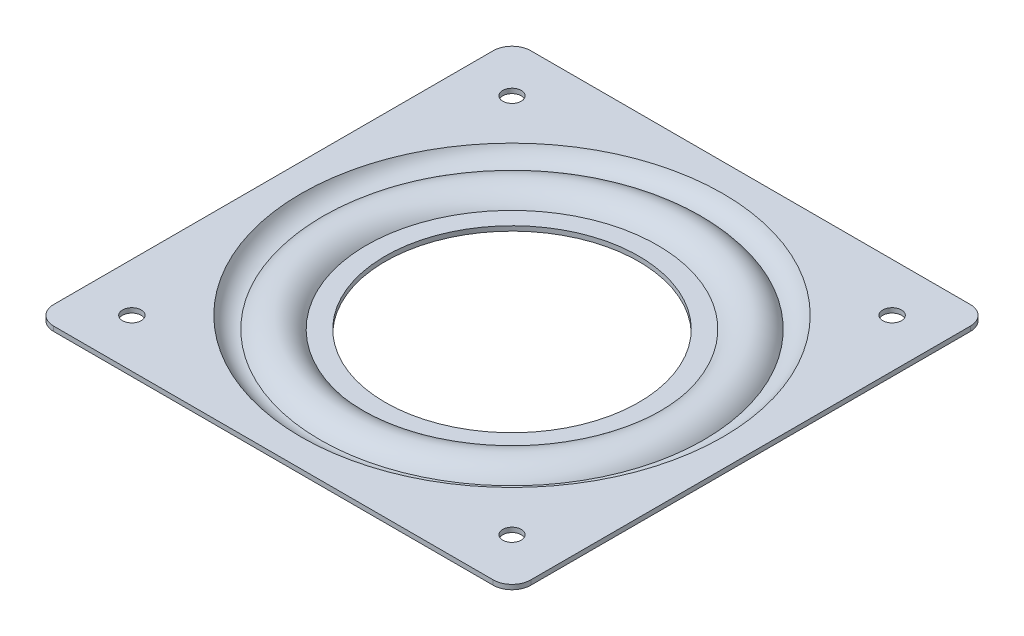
from build123d import *

# Parameters (mm, degrees)
SKETCH_2_R      = 1.985
SKETCH_2_R_2    = 44.910539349
EXTRUDE_1_DEPTH = 1


with BuildPart() as part:
    # Sketch 1 → Revolve 1 (revolve)
    with BuildSketch(Plane.XY, mode=Mode.PRIVATE) as revolve_1_sk:
        with BuildLine():
            ThreePointArc((-45.813874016, -0.428936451), (-43.539426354, -2.86488143), (-40.275857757, -3.540203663))
            ThreePointArc((-40.275857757, -3.540203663), (-35.905809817, -1.000028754), (-31.553091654, -3.569785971))
            Line((-31.553091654, -3.569785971), (-27, -3.569785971))
            Line((-27, -3.569785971), (-27, -2.569785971))
            Line((-27, -2.569785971), (-31, -2.569785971))
            ThreePointArc((-31, -2.569785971), (-35.922766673, 0), (-40.845533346, -2.569785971))
            ThreePointArc((-40.845533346, -2.569785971), (-43.250116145, -1.873465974), (-44.910539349, 0))
            Line((-44.910539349, 0), (-45.813874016, -0.428936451))
        make_face()
    revolve(revolve_1_sk.sketch.rotate(Axis((0, 6.917160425, 0), (0, -1, 0)), 270), axis=Axis((0, 6.917160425, 0), (0, -1, 0)))

    # Sketch 2 → Extrude 1 (add)
    with BuildSketch(Plane(origin=(0, 0, 0), x_dir=(1, 0, 0), z_dir=(0, 1, 0))):
        with BuildLine():
            Line((46.8, 50.8), (-46.8, 50.8))
            ThreePointArc((-46.8, 50.8), (-49.628427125, 49.628427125), (-50.8, 46.8))
            Line((-50.8, 46.8), (-50.8, -46.8))
            ThreePointArc((-50.8, -46.8), (-49.628427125, -49.628427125), (-46.8, -50.8))
            Line((-46.8, -50.8), (46.8, -50.8))
            ThreePointArc((46.8, -50.8), (49.628427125, -49.628427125), (50.8, -46.8))
            Line((50.8, -46.8), (50.8, 46.8))
            ThreePointArc((50.8, 46.8), (49.628427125, 49.628427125), (46.8, 50.8))
        make_face()
        with Locations(Location((-40.48, -40.48, 0), (0, 0, 270))):
            Circle(SKETCH_2_R, mode=Mode.SUBTRACT)
        with Locations(Location((40.48, -40.48, 0), (0, 0, 270))):
            Circle(SKETCH_2_R, mode=Mode.SUBTRACT)
        Circle(SKETCH_2_R_2, mode=Mode.SUBTRACT)
        with Locations(Location((-40.48, 40.48, 0), (0, 0, 270))):
            Circle(SKETCH_2_R, mode=Mode.SUBTRACT)
        with Locations(Location((40.48, 40.48, 0), (0, 0, 270))):
            Circle(SKETCH_2_R, mode=Mode.SUBTRACT)
    extrude(amount=-EXTRUDE_1_DEPTH)


solid = part.part
